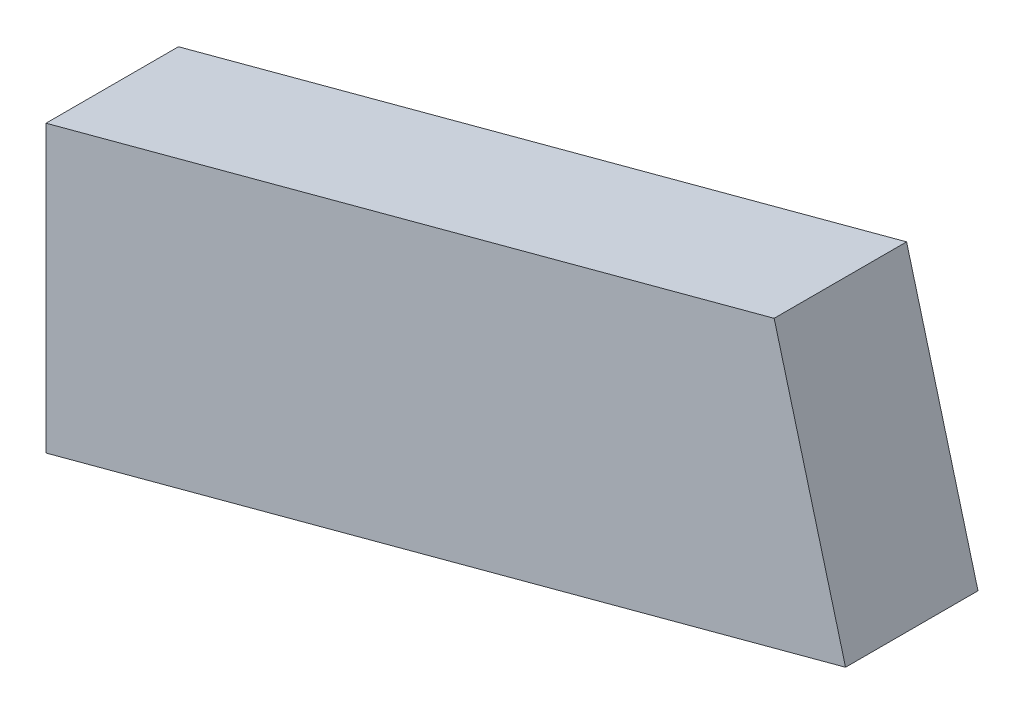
ISO-10303-21;
HEADER;
FILE_DESCRIPTION(('STEP AP214'),'2;1');
FILE_NAME('part.step','',(''),(''),'','','');
FILE_SCHEMA(('AUTOMOTIVE_DESIGN { 1 0 10303 214 1 1 1 1 }'));
ENDSEC;
DATA;
#1=APPLICATION_CONTEXT('core data for automotive mechanical design processes');
#2=APPLICATION_PROTOCOL_DEFINITION('international standard','automotive_design',2000,#1);
#3=PRODUCT_CONTEXT('',#1,'mechanical');
#4=PRODUCT('Part','Part','',(#3));
#5=PRODUCT_RELATED_PRODUCT_CATEGORY('part','',(#4));
#6=PRODUCT_DEFINITION_FORMATION('','',#4);
#7=PRODUCT_DEFINITION_CONTEXT('part definition',#1,'design');
#8=PRODUCT_DEFINITION('design','',#6,#7);
#9=PRODUCT_DEFINITION_SHAPE('','',#8);
#10=(LENGTH_UNIT() NAMED_UNIT(*) SI_UNIT(.MILLI.,.METRE.));
#11=(NAMED_UNIT(*) PLANE_ANGLE_UNIT() SI_UNIT($,.RADIAN.));
#12=(NAMED_UNIT(*) SI_UNIT($,.STERADIAN.) SOLID_ANGLE_UNIT());
#13=UNCERTAINTY_MEASURE_WITH_UNIT(LENGTH_MEASURE(1.E-05),#10,'distance_accuracy_value','');
#14=(GEOMETRIC_REPRESENTATION_CONTEXT(3) GLOBAL_UNCERTAINTY_ASSIGNED_CONTEXT((#13)) GLOBAL_UNIT_ASSIGNED_CONTEXT((#10,
#11,#12)) REPRESENTATION_CONTEXT('',''));
#15=CARTESIAN_POINT('',(0.,0.,0.));
#16=DIRECTION('',(0.,0.,1.));
#17=DIRECTION('',(1.,0.,0.));
#18=AXIS2_PLACEMENT_3D('',#15,#16,#17);
#19=CARTESIAN_POINT('',(72.4444369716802,19.4114283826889,12.));
#20=DIRECTION('',(-0.258819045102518,0.965925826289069,0.));
#21=DIRECTION('',(-0.965925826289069,-0.258819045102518,0.));
#22=AXIS2_PLACEMENT_3D('',#19,#20,#21);
#23=PLANE('',#22);
#24=DIRECTION('',(0.965925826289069,0.258819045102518,0.));
#25=VECTOR('',#24,1.);
#26=CARTESIAN_POINT('',(72.4444369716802,19.4114283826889,0.));
#27=LINE('',#26,#25);
#28=CARTESIAN_POINT('',(0.,0.,0.));
#29=VERTEX_POINT('',#28);
#30=CARTESIAN_POINT('',(72.4444369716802,19.4114283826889,0.));
#31=VERTEX_POINT('',#30);
#32=EDGE_CURVE('E95',#29,#31,#27,.T.);
#33=ORIENTED_EDGE('',*,*,#32,.T.);
#34=DIRECTION('',(0.,0.,-1.));
#35=VECTOR('',#34,1.);
#36=CARTESIAN_POINT('',(72.4444369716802,19.4114283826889,12.));
#37=LINE('',#36,#35);
#38=CARTESIAN_POINT('',(72.4444369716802,19.4114283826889,12.));
#39=VERTEX_POINT('',#38);
#40=EDGE_CURVE('E11',#39,#31,#37,.T.);
#41=ORIENTED_EDGE('',*,*,#40,.F.);
#42=DIRECTION('',(0.965925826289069,0.258819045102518,0.));
#43=VECTOR('',#42,1.);
#44=CARTESIAN_POINT('',(72.4444369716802,19.4114283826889,12.));
#45=LINE('',#44,#43);
#46=CARTESIAN_POINT('',(0.,0.,12.));
#47=VERTEX_POINT('',#46);
#48=EDGE_CURVE('E83',#47,#39,#45,.T.);
#49=ORIENTED_EDGE('',*,*,#48,.F.);
#50=DIRECTION('',(0.,0.,-1.));
#51=VECTOR('',#50,1.);
#52=CARTESIAN_POINT('',(0.,0.,12.));
#53=LINE('',#52,#51);
#54=EDGE_CURVE('E91',#47,#29,#53,.T.);
#55=ORIENTED_EDGE('',*,*,#54,.T.);
#56=EDGE_LOOP('',(#33,#41,#49,#55));
#57=FACE_BOUND('',#56,.T.);
#58=ADVANCED_FACE('F32',(#57),#23,.F.);
#59=CARTESIAN_POINT('',(65.9739608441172,43.5595740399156,12.));
#60=DIRECTION('',(-0.965925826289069,-0.258819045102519,0.));
#61=DIRECTION('',(0.258819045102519,-0.965925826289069,0.));
#62=AXIS2_PLACEMENT_3D('',#59,#60,#61);
#63=PLANE('',#62);
#64=DIRECTION('',(-0.258819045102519,0.965925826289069,0.));
#65=VECTOR('',#64,1.);
#66=CARTESIAN_POINT('',(65.9739608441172,43.5595740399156,0.));
#67=LINE('',#66,#65);
#68=CARTESIAN_POINT('',(65.9739608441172,43.5595740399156,0.));
#69=VERTEX_POINT('',#68);
#70=EDGE_CURVE('E87',#31,#69,#67,.T.);
#71=ORIENTED_EDGE('',*,*,#70,.T.);
#72=DIRECTION('',(0.,0.,-1.));
#73=VECTOR('',#72,1.);
#74=CARTESIAN_POINT('',(65.9739608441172,43.5595740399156,12.));
#75=LINE('',#74,#73);
#76=CARTESIAN_POINT('',(65.9739608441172,43.5595740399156,12.));
#77=VERTEX_POINT('',#76);
#78=EDGE_CURVE('E40',#77,#69,#75,.T.);
#79=ORIENTED_EDGE('',*,*,#78,.F.);
#80=DIRECTION('',(-0.258819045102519,0.965925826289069,0.));
#81=VECTOR('',#80,1.);
#82=CARTESIAN_POINT('',(65.9739608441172,43.5595740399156,12.));
#83=LINE('',#82,#81);
#84=EDGE_CURVE('E78',#39,#77,#83,.T.);
#85=ORIENTED_EDGE('',*,*,#84,.F.);
#86=ORIENTED_EDGE('',*,*,#40,.T.);
#87=EDGE_LOOP('',(#71,#79,#85,#86));
#88=FACE_BOUND('',#87,.T.);
#89=ADVANCED_FACE('F86',(#88),#63,.F.);
#90=CARTESIAN_POINT('',(0.,25.8819045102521,12.));
#91=DIRECTION('',(0.258819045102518,-0.965925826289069,0.));
#92=DIRECTION('',(0.965925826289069,0.258819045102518,0.));
#93=AXIS2_PLACEMENT_3D('',#90,#91,#92);
#94=PLANE('',#93);
#95=DIRECTION('',(-0.965925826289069,-0.258819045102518,0.));
#96=VECTOR('',#95,1.);
#97=CARTESIAN_POINT('',(0.,25.8819045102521,0.));
#98=LINE('',#97,#96);
#99=CARTESIAN_POINT('',(0.,25.8819045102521,0.));
#100=VERTEX_POINT('',#99);
#101=EDGE_CURVE('E65',#69,#100,#98,.T.);
#102=ORIENTED_EDGE('',*,*,#101,.T.);
#103=DIRECTION('',(0.,0.,-1.));
#104=VECTOR('',#103,1.);
#105=CARTESIAN_POINT('',(0.,25.8819045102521,12.));
#106=LINE('',#105,#104);
#107=CARTESIAN_POINT('',(0.,25.8819045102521,12.));
#108=VERTEX_POINT('',#107);
#109=EDGE_CURVE('E88',#108,#100,#106,.T.);
#110=ORIENTED_EDGE('',*,*,#109,.F.);
#111=DIRECTION('',(-0.965925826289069,-0.258819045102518,0.));
#112=VECTOR('',#111,1.);
#113=CARTESIAN_POINT('',(0.,25.8819045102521,12.));
#114=LINE('',#113,#112);
#115=EDGE_CURVE('E81',#77,#108,#114,.T.);
#116=ORIENTED_EDGE('',*,*,#115,.F.);
#117=ORIENTED_EDGE('',*,*,#78,.T.);
#118=EDGE_LOOP('',(#102,#110,#116,#117));
#119=FACE_BOUND('',#118,.T.);
#120=ADVANCED_FACE('F89',(#119),#94,.F.);
#121=CARTESIAN_POINT('',(0.,0.,12.));
#122=DIRECTION('',(1.,0.,0.));
#123=DIRECTION('',(0.,1.,0.));
#124=AXIS2_PLACEMENT_3D('',#121,#122,#123);
#125=PLANE('',#124);
#126=DIRECTION('',(0.,-1.,0.));
#127=VECTOR('',#126,1.);
#128=CARTESIAN_POINT('',(0.,0.,0.));
#129=LINE('',#128,#127);
#130=EDGE_CURVE('E71',#100,#29,#129,.T.);
#131=ORIENTED_EDGE('',*,*,#130,.T.);
#132=ORIENTED_EDGE('',*,*,#54,.F.);
#133=DIRECTION('',(0.,-1.,0.));
#134=VECTOR('',#133,1.);
#135=CARTESIAN_POINT('',(0.,0.,12.));
#136=LINE('',#135,#134);
#137=EDGE_CURVE('E48',#108,#47,#136,.T.);
#138=ORIENTED_EDGE('',*,*,#137,.F.);
#139=ORIENTED_EDGE('',*,*,#109,.T.);
#140=EDGE_LOOP('',(#131,#132,#138,#139));
#141=FACE_BOUND('',#140,.T.);
#142=ADVANCED_FACE('F102',(#141),#125,.F.);
#143=CARTESIAN_POINT('',(0.,0.,12.));
#144=DIRECTION('',(0.,0.,1.));
#145=DIRECTION('',(1.,0.,0.));
#146=AXIS2_PLACEMENT_3D('',#143,#144,#145);
#147=PLANE('',#146);
#148=ORIENTED_EDGE('',*,*,#48,.T.);
#149=ORIENTED_EDGE('',*,*,#84,.T.);
#150=ORIENTED_EDGE('',*,*,#115,.T.);
#151=ORIENTED_EDGE('',*,*,#137,.T.);
#152=EDGE_LOOP('',(#148,#149,#150,#151));
#153=FACE_BOUND('',#152,.T.);
#154=ADVANCED_FACE('F79',(#153),#147,.T.);
#155=CARTESIAN_POINT('',(0.,0.,0.));
#156=DIRECTION('',(0.,0.,1.));
#157=DIRECTION('',(1.,0.,0.));
#158=AXIS2_PLACEMENT_3D('',#155,#156,#157);
#159=PLANE('',#158);
#160=ORIENTED_EDGE('',*,*,#32,.F.);
#161=ORIENTED_EDGE('',*,*,#130,.F.);
#162=ORIENTED_EDGE('',*,*,#101,.F.);
#163=ORIENTED_EDGE('',*,*,#70,.F.);
#164=EDGE_LOOP('',(#160,#161,#162,#163));
#165=FACE_BOUND('',#164,.T.);
#166=ADVANCED_FACE('F105',(#165),#159,.F.);
#167=CLOSED_SHELL('',(#58,#89,#120,#142,#154,#166));
#168=MANIFOLD_SOLID_BREP('B2',#167);
#169=ADVANCED_BREP_SHAPE_REPRESENTATION('',(#18,#168),#14);
#170=SHAPE_DEFINITION_REPRESENTATION(#9,#169);
ENDSEC;
END-ISO-10303-21;
